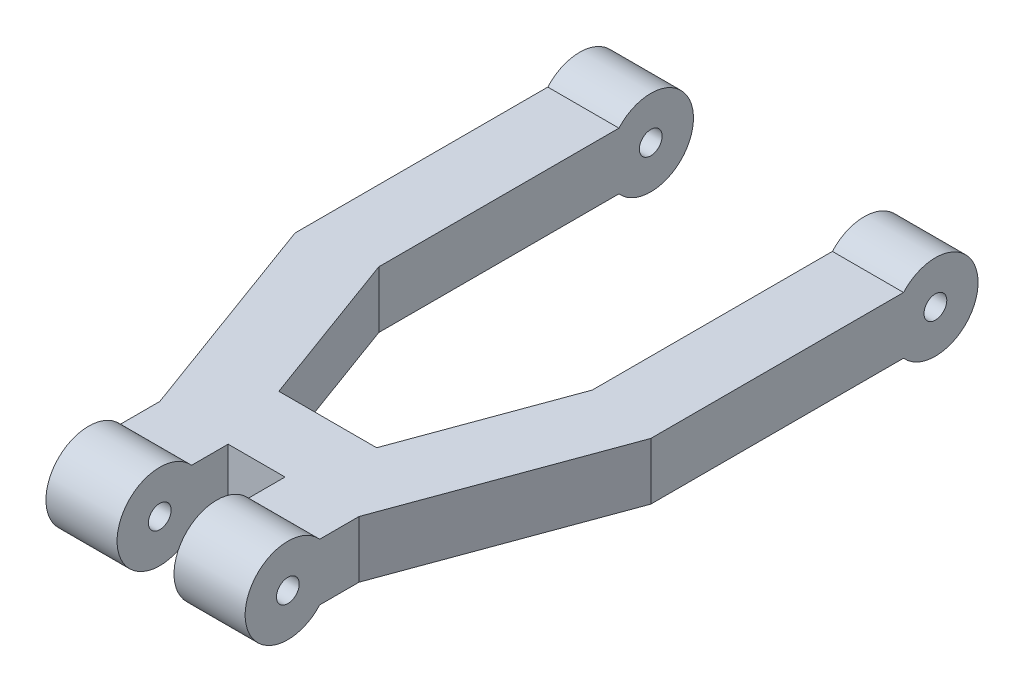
from build123d import *

# Parameters (mm, degrees)
SKETCH1_W               = 50.8
SKETCH1_H               = 5.08
BOSS_EXTRUDE1_DEPTH     = 31.75
SKETCH2_R               = 3.81
BOSS_EXTRUDE2_DEPTH     = 31.75
CUT_EXTRUDE1_DEPTH      = 64.48729873
CUT_EXTRUDE1_DEPTH_BACK = 64.48729873
SKETCH3_W               = 5.08
SKETCH3_H               = 13.661235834
SKETCH4_R               = 1.016
CUT_EXTRUDE2_DEPTH      = 64.48729873


with BuildPart() as part:
    # Sketch1 → Boss-Extrude1 (new body)
    with BuildSketch(Plane(origin=(0, 0, 0), x_dir=(0, 0, -1), z_dir=(1, 0, 0))):
        with Locations((25.4, 2.54)):
            Rectangle(SKETCH1_W, SKETCH1_H)
    extrude(amount=BOSS_EXTRUDE1_DEPTH)

    # Sketch2 → Boss-Extrude2 (add)
    with BuildSketch(Plane(origin=(31.75, 0, 0), x_dir=(0, 0, -1), z_dir=(1, 0, 0))):
        with Locations((0, 2.54)):
            Circle(SKETCH2_R)
        with Locations((50.8, 2.54)):
            Circle(SKETCH2_R)
    extrude(amount=-BOSS_EXTRUDE2_DEPTH)

    # Sketch3 → Cut-Extrude1 (cut, two sides: drawn at the far end of the back side and taken through both)
    with BuildSketch(Plane(origin=(0, 5.08, 0), x_dir=(1, 0, 0), z_dir=(0, 1, 0)).offset(-CUT_EXTRUDE1_DEPTH_BACK)):
        Polygon((0, 25.4), (6.985, 6.35), (6.985, -6.172591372), (-2.607349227, -6.172591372), (-2.607349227, 25.4), align=None)
        Polygon((6.35, 57.910070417), (6.35, 26.527465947), (11.511944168, 12.449436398), (20.238055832, 12.449436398), (25.4, 26.527465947), (25.4, 57.910070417), align=None)
        Polygon((34.357349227, -6.172591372), (34.357349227, 25.4), (31.75, 25.4), (24.765, 6.35), (24.765, -6.172591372), align=None)
        with Locations((15.875, -0.731181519)):
            Rectangle(SKETCH3_W, SKETCH3_H)
    extrude(amount=CUT_EXTRUDE1_DEPTH + CUT_EXTRUDE1_DEPTH_BACK, mode=Mode.SUBTRACT)

    # Sketch4 → Cut-Extrude2 (cut, through all)
    with BuildSketch(Plane.ZY):
        with Locations((-50.8, 2.54)):
            Circle(SKETCH4_R)
        with Locations((0, 2.54)):
            Circle(SKETCH4_R)
    extrude(amount=-CUT_EXTRUDE2_DEPTH, mode=Mode.SUBTRACT)


solid = part.part
